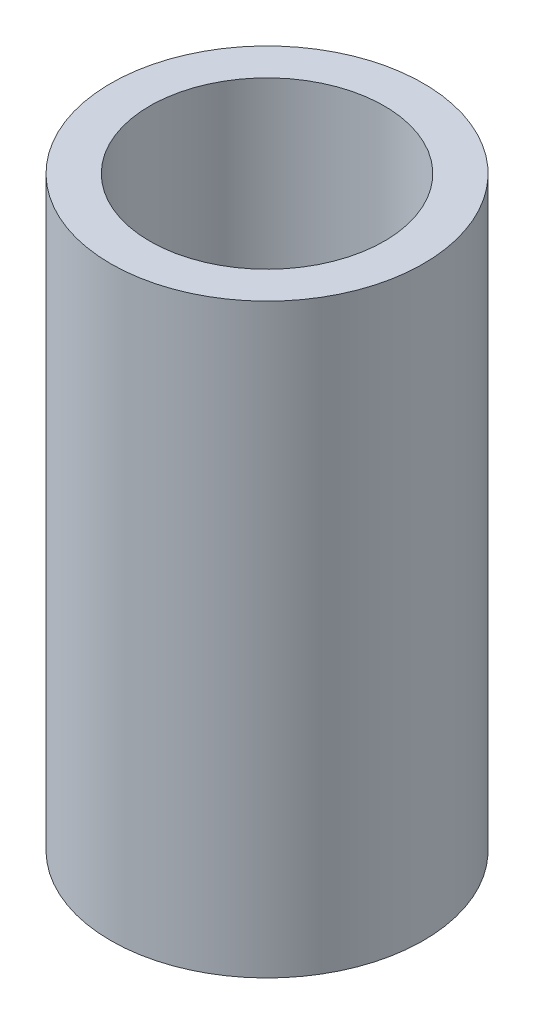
ISO-10303-21;
HEADER;
FILE_DESCRIPTION(('STEP AP214'),'2;1');
FILE_NAME('part.step','',(''),(''),'','','');
FILE_SCHEMA(('AUTOMOTIVE_DESIGN { 1 0 10303 214 1 1 1 1 }'));
ENDSEC;
DATA;
#1=APPLICATION_CONTEXT('core data for automotive mechanical design processes');
#2=APPLICATION_PROTOCOL_DEFINITION('international standard','automotive_design',2000,#1);
#3=PRODUCT_CONTEXT('',#1,'mechanical');
#4=PRODUCT('Part','Part','',(#3));
#5=PRODUCT_RELATED_PRODUCT_CATEGORY('part','',(#4));
#6=PRODUCT_DEFINITION_FORMATION('','',#4);
#7=PRODUCT_DEFINITION_CONTEXT('part definition',#1,'design');
#8=PRODUCT_DEFINITION('design','',#6,#7);
#9=PRODUCT_DEFINITION_SHAPE('','',#8);
#10=(LENGTH_UNIT() NAMED_UNIT(*) SI_UNIT(.MILLI.,.METRE.));
#11=(NAMED_UNIT(*) PLANE_ANGLE_UNIT() SI_UNIT($,.RADIAN.));
#12=(NAMED_UNIT(*) SI_UNIT($,.STERADIAN.) SOLID_ANGLE_UNIT());
#13=UNCERTAINTY_MEASURE_WITH_UNIT(LENGTH_MEASURE(1.E-05),#10,'distance_accuracy_value','');
#14=(GEOMETRIC_REPRESENTATION_CONTEXT(3) GLOBAL_UNCERTAINTY_ASSIGNED_CONTEXT((#13)) GLOBAL_UNIT_ASSIGNED_CONTEXT((#10,
#11,#12)) REPRESENTATION_CONTEXT('',''));
#15=CARTESIAN_POINT('',(0.,0.,0.));
#16=DIRECTION('',(0.,0.,1.));
#17=DIRECTION('',(1.,0.,0.));
#18=AXIS2_PLACEMENT_3D('',#15,#16,#17);
#19=CARTESIAN_POINT('',(0.,7.5,0.));
#20=DIRECTION('',(0.,1.,0.));
#21=DIRECTION('',(0.,0.,1.));
#22=AXIS2_PLACEMENT_3D('',#19,#20,#21);
#23=PLANE('',#22);
#24=CARTESIAN_POINT('',(0.,7.5,0.));
#25=DIRECTION('',(0.,1.,0.));
#26=DIRECTION('',(0.,0.,1.));
#27=AXIS2_PLACEMENT_3D('',#24,#25,#26);
#28=CIRCLE('',#27,2.);
#29=CARTESIAN_POINT('',(0.,7.5,2.));
#30=VERTEX_POINT('',#29);
#31=EDGE_CURVE('E10',#30,#30,#28,.T.);
#32=ORIENTED_EDGE('',*,*,#31,.T.);
#33=EDGE_LOOP('',(#32));
#34=FACE_BOUND('',#33,.T.);
#35=CARTESIAN_POINT('',(0.,7.5,0.));
#36=DIRECTION('',(0.,1.,0.));
#37=DIRECTION('',(0.,0.,1.));
#38=AXIS2_PLACEMENT_3D('',#35,#36,#37);
#39=CIRCLE('',#38,1.5);
#40=CARTESIAN_POINT('',(0.,7.5,1.5));
#41=VERTEX_POINT('',#40);
#42=EDGE_CURVE('E44',#41,#41,#39,.T.);
#43=ORIENTED_EDGE('',*,*,#42,.F.);
#44=EDGE_LOOP('',(#43));
#45=FACE_BOUND('',#44,.T.);
#46=ADVANCED_FACE('F33',(#34,#45),#23,.T.);
#47=CARTESIAN_POINT('',(0.,0.,0.));
#48=DIRECTION('',(0.,1.,0.));
#49=DIRECTION('',(0.,0.,1.));
#50=AXIS2_PLACEMENT_3D('',#47,#48,#49);
#51=PLANE('',#50);
#52=CARTESIAN_POINT('',(0.,0.,0.));
#53=DIRECTION('',(0.,1.,0.));
#54=DIRECTION('',(0.,0.,1.));
#55=AXIS2_PLACEMENT_3D('',#52,#53,#54);
#56=CIRCLE('',#55,2.);
#57=CARTESIAN_POINT('',(0.,0.,2.));
#58=VERTEX_POINT('',#57);
#59=EDGE_CURVE('E37',#58,#58,#56,.T.);
#60=ORIENTED_EDGE('',*,*,#59,.F.);
#61=EDGE_LOOP('',(#60));
#62=FACE_BOUND('',#61,.T.);
#63=CARTESIAN_POINT('',(0.,0.,0.));
#64=DIRECTION('',(0.,1.,0.));
#65=DIRECTION('',(0.,0.,1.));
#66=AXIS2_PLACEMENT_3D('',#63,#64,#65);
#67=CIRCLE('',#66,1.5);
#68=CARTESIAN_POINT('',(0.,0.,1.5));
#69=VERTEX_POINT('',#68);
#70=EDGE_CURVE('E46',#69,#69,#67,.T.);
#71=ORIENTED_EDGE('',*,*,#70,.T.);
#72=EDGE_LOOP('',(#71));
#73=FACE_BOUND('',#72,.T.);
#74=ADVANCED_FACE('F56',(#62,#73),#51,.F.);
#75=CARTESIAN_POINT('',(0.,7.5,0.));
#76=DIRECTION('',(0.,-1.,0.));
#77=DIRECTION('',(0.,0.,-1.));
#78=AXIS2_PLACEMENT_3D('',#75,#76,#77);
#79=CYLINDRICAL_SURFACE('',#78,2.);
#80=ORIENTED_EDGE('',*,*,#31,.F.);
#81=EDGE_LOOP('',(#80));
#82=FACE_BOUND('',#81,.T.);
#83=ORIENTED_EDGE('',*,*,#59,.T.);
#84=EDGE_LOOP('',(#83));
#85=FACE_BOUND('',#84,.T.);
#86=ADVANCED_FACE('F35',(#82,#85),#79,.T.);
#87=CARTESIAN_POINT('',(0.,7.5,0.));
#88=DIRECTION('',(0.,-1.,0.));
#89=DIRECTION('',(0.,0.,-1.));
#90=AXIS2_PLACEMENT_3D('',#87,#88,#89);
#91=CYLINDRICAL_SURFACE('',#90,1.5);
#92=ORIENTED_EDGE('',*,*,#42,.T.);
#93=EDGE_LOOP('',(#92));
#94=FACE_BOUND('',#93,.T.);
#95=ORIENTED_EDGE('',*,*,#70,.F.);
#96=EDGE_LOOP('',(#95));
#97=FACE_BOUND('',#96,.T.);
#98=ADVANCED_FACE('F52',(#94,#97),#91,.F.);
#99=CLOSED_SHELL('',(#46,#74,#86,#98));
#100=MANIFOLD_SOLID_BREP('B2',#99);
#101=ADVANCED_BREP_SHAPE_REPRESENTATION('',(#18,#100),#14);
#102=SHAPE_DEFINITION_REPRESENTATION(#9,#101);
ENDSEC;
END-ISO-10303-21;
